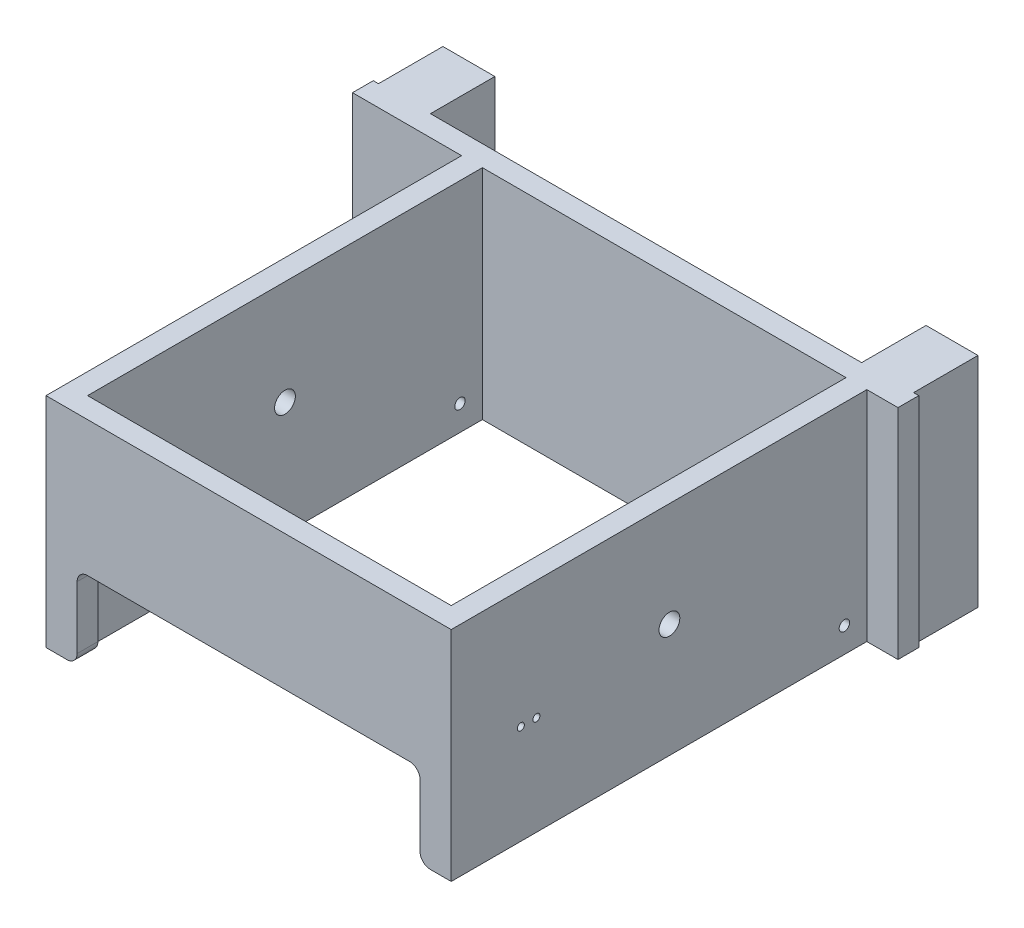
from build123d import *

# Parameters (mm, degrees)
ESQUISSE1_W                     = 525
ESQUISSE1_H                     = 210
BOSS_EXTRU_1_DEPTH              = 20
ESQUISSE2_W                     = 20
ESQUISSE2_H                     = 210
BOSS_EXTRU_2_DEPTH              = 400
ESQUISSE3_W                     = 20
ESQUISSE3_H                     = 210
BOSS_EXTRU_3_DEPTH              = 350
ESQUISSE4_R                     = 10
ESQUISSE4_R_2                   = 5
ENL_V_MAT_EXTRU_1_DEPTH         = 672.911541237
ESQUISSE5_W                     = 50
ESQUISSE5_H                     = 210
BOSS_EXTRU_4_DEPTH              = 62
TROU_TARAUD_M81_D               = 6.8
R_P_TITION_LIN_AIRE1_COUNT      = 2
R_P_TITION_LIN_AIRE1_PITCH      = 130
R_P_TITION_LIN_AIRE1_COUNT_DIR2 = 2
R_P_TITION_LIN_AIRE1_PITCH_DIR2 = 471
ESQUISSE10_W                    = 330
ESQUISSE10_H                    = 80
ENL_V_MAT_EXTRU_2_DEPTH         = 30
CONG_1_R                        = 10


with BuildPart() as part:
    # Esquisse1 → Boss.-Extru.1 (new body)
    with BuildSketch(Plane.XY):
        with Locations((197.725027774, -68.320856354)):
            Rectangle(ESQUISSE1_W, ESQUISSE1_H)
    extrude(amount=BOSS_EXTRU_1_DEPTH)

    # Esquisse2 → Boss.-Extru.2 (add)
    with BuildSketch(Plane.XY.offset(20)):
        with Locations((420.225027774, -68.320856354)):
            Rectangle(ESQUISSE2_W, ESQUISSE2_H)
        with Locations((50.225027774, -68.320856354)):
            Rectangle(ESQUISSE2_W, ESQUISSE2_H)
    extrude(amount=BOSS_EXTRU_2_DEPTH)

    # Esquisse3 → Boss.-Extru.3 (add)
    with BuildSketch(Plane.ZY.offset(-410.225027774)):
        with Locations((410, -68.320856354)):
            Rectangle(ESQUISSE3_W, ESQUISSE3_H)
    extrude(amount=BOSS_EXTRU_3_DEPTH)

    # Esquisse4 → Enl_v. mat.-Extru.1 (cut, through all)
    with BuildSketch(Plane(origin=(430.225027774, 0, 0), x_dir=(0, 0, -1), z_dir=(1, 0, 0))):
        with Locations(Location((-210, -63.820856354, 0), (0, 0, 90))):
            Circle(ESQUISSE4_R)
        with Locations(Location((-41.596722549, -149.158160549, 0), (0, 0, 90))):
            Circle(ESQUISSE4_R_2)
    extrude(amount=-ENL_V_MAT_EXTRU_1_DEPTH, mode=Mode.SUBTRACT)

    # Esquisse5 → Boss.-Extru.4 (add)
    with BuildSketch(Plane(origin=(0, 0, 0), x_dir=(-1, 0, 0), z_dir=(0, 0, -1))):
        with Locations((34.774972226, -68.320856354)):
            Rectangle(ESQUISSE5_W, ESQUISSE5_H)
        with Locations((-430.225027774, -68.320856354)):
            Rectangle(ESQUISSE5_W, ESQUISSE5_H)
    extrude(amount=BOSS_EXTRU_4_DEPTH)

    # Trou taraud_ M81 (through all)
    with Locations(Plane.ZY.offset(-40.225027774)):
        with Locations((353, -77.820856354), (338, -77.820856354)):
            Hole(TROU_TARAUD_M81_D / 2)

    # Esquisse8 → Trou taraud_ M101 (revolve, cut)
    with BuildSketch(Plane(origin=(433.225027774, -3.320856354, -62), x_dir=(0, 1, 0), z_dir=(1, 0, 0))):
        Polygon((0, 0), (0, 37.053657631), (4.25, 34.5), (4.25, 0.775), (5.025, 0), align=None)
    trou_taraud_m101 = revolve(axis=Axis((433.225027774, -3.320856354, -68.35), (0, 0, 1)), mode=Mode.SUBTRACT)

    # R_p_tition lin_aire1: Trou taraud_ M101 2 × 2
    with Locations(*[(-j * R_P_TITION_LIN_AIRE1_PITCH_DIR2, -i * R_P_TITION_LIN_AIRE1_PITCH, 0) for i in range(R_P_TITION_LIN_AIRE1_COUNT) for j in range(R_P_TITION_LIN_AIRE1_COUNT_DIR2) if (i, j) != (0, 0)]):
        add(trou_taraud_m101, mode=Mode.SUBTRACT)

    # Esquisse10 → Enl_v. mat.-Extru.2 (cut)
    with BuildSketch(Plane.XY.offset(420)):
        with Locations((235.225027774, -133.320856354)):
            Rectangle(ESQUISSE10_W, ESQUISSE10_H)
    extrude(amount=-ENL_V_MAT_EXTRU_2_DEPTH, mode=Mode.SUBTRACT)

    # Cong_1
    cong_1_edges = [part.edges().sort_by_distance(p)[0] for p in [
        (70.225027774, -93.320856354, 410),
        (70.225027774, -173.320856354, 410),
        (400.225027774, -93.320856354, 410),
        (400.225027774, -173.320856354, 410),
    ]]
    fillet(cong_1_edges, radius=CONG_1_R)


solid = part.part
